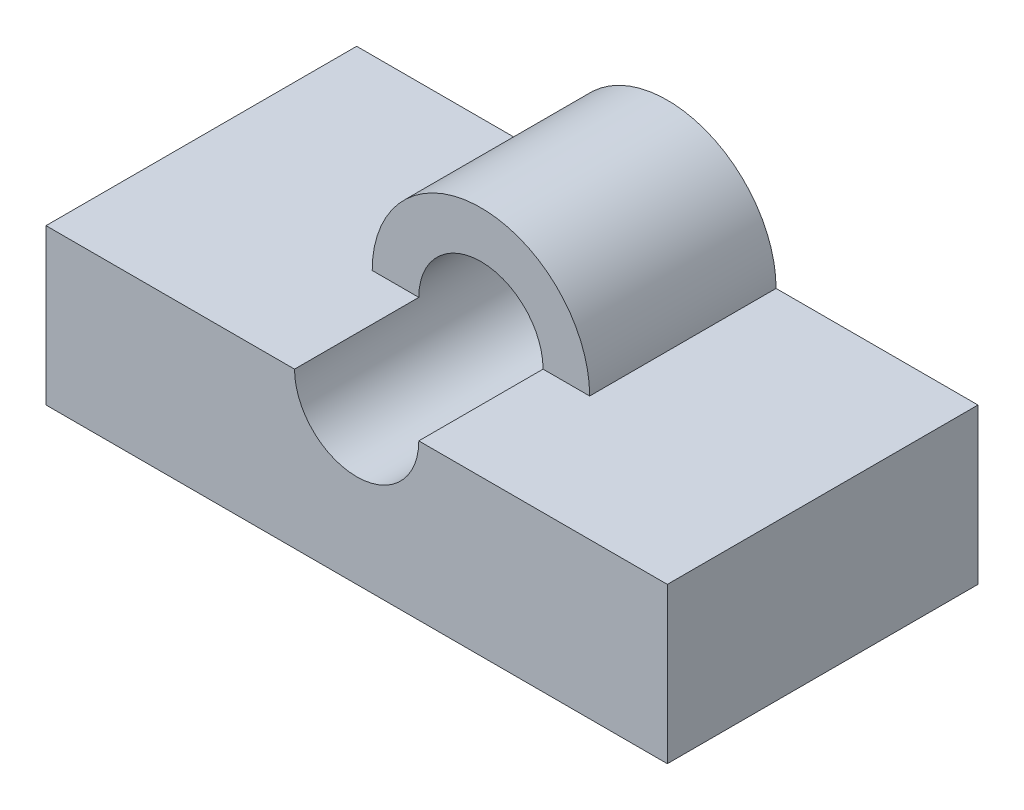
from build123d import *

# Parameters (mm, degrees)
BOSS_EXTRUDE1_DEPTH = 50
BOSS_EXTRUDE2_DEPTH = 30


with BuildPart() as part:
    # Sketch1 → Boss-Extrude1 (new body)
    with BuildSketch(Plane.XY):
        with BuildLine():
            Line((0, 25), (0, 0))
            Line((0, 0), (100, 0))
            Line((100, 0), (100, 25))
            Line((100, 25), (60, 25))
            ThreePointArc((60, 25), (50, 15), (40, 25))
            Line((40, 25), (0, 25))
        make_face()
    extrude(amount=BOSS_EXTRUDE1_DEPTH)

    # Sketch1_3 → Boss-Extrude2 (add)
    with BuildSketch(Plane.XY):
        with BuildLine():
            ThreePointArc((67.5, 25), (50, 42.5), (32.5, 25))
            Line((32.5, 25), (40, 25))
            ThreePointArc((40, 25), (50, 35), (60, 25))
            Line((60, 25), (67.5, 25))
        make_face()
        with BuildLine():
            Line((40, 25), (32.5, 25))
            ThreePointArc((32.5, 25), (50, 7.5), (67.5, 25))
            Line((67.5, 25), (60, 25))
            ThreePointArc((60, 25), (50, 15), (40, 25))
        make_face()
        with BuildLine():
            ThreePointArc((67.5, 25), (50, 42.5), (32.5, 25))
            Line((32.5, 25), (40, 25))
            ThreePointArc((40, 25), (50, 35), (60, 25))
            Line((60, 25), (67.5, 25))
        make_face()
        with BuildLine():
            Line((40, 25), (32.5, 25))
            ThreePointArc((32.5, 25), (50, 7.5), (67.5, 25))
            Line((67.5, 25), (60, 25))
            ThreePointArc((60, 25), (50, 15), (40, 25))
        make_face()
    extrude(amount=BOSS_EXTRUDE2_DEPTH)


solid = part.part
